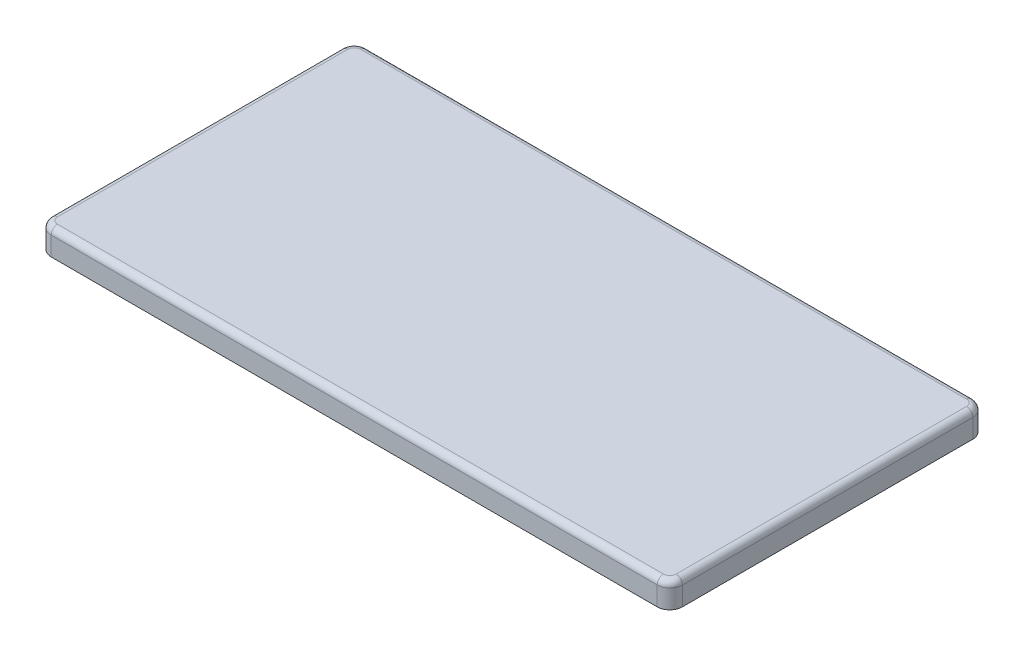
from build123d import *

# Parameters (mm, degrees)
EXTRUDE_1_DEPTH           = 2
FILLET_1_R                = 1
CUT_EXTRUDE_2_DEPTH       = 2
EXTRUDE_4_DEPTH           = 11
EXTRUDE_4_DRAFT           = 0.5
EXTRUDE_4_PROFILE_2_DEPTH = 11
EXTRUDE_4_PROFILE_2_DRAFT = 0.5
FILLET_2_R                = 0.8


with BuildPart() as part:
    # Sketch 1 → Extrude 1 (new, symmetric)
    with BuildSketch(Plane(origin=(0, 0, 0), x_dir=(0, 0, -1), z_dir=(0, 1, 0))):
        with BuildLine():
            Line((-23, 50), (23, 50))
            ThreePointArc((23, 50), (24.414213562, 49.414213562), (25, 48))
            Line((25, 48), (25, -48))
            ThreePointArc((25, -48), (24.414213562, -49.414213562), (23, -50))
            Line((23, -50), (-23, -50))
            ThreePointArc((-23, -50), (-24.414213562, -49.414213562), (-25, -48))
            Line((-25, -48), (-25, 48))
            ThreePointArc((-25, 48), (-24.414213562, 49.414213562), (-23, 50))
        make_face()
    extrude(amount=EXTRUDE_1_DEPTH, both=True)

    # Fillet 1
    fillet_1_edges = [part.edges().sort_by_distance(p)[0] for p in [
        (-49.414213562, 2, 24.414213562),
        (0, 2, 25),
        (49.414213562, 2, 24.414213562),
        (50, 2, 0),
        (49.414213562, 2, -24.414213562),
        (0, 2, -25),
        (-49.414213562, 2, -24.414213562),
        (-50, 2, 0),
    ]]
    fillet(fillet_1_edges, radius=FILLET_1_R)

    # Sketch 2 → Cut-Extrude 2 (cut)
    with BuildSketch(Plane.XZ.offset(2)):
        with BuildLine():
            Line((-47.2, 23), (47.2, 23))
            ThreePointArc((47.2, 23), (47.765685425, 22.765685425), (48, 22.2))
            Line((48, 22.2), (48, -22.2))
            ThreePointArc((48, -22.2), (47.765685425, -22.765685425), (47.2, -23))
            Line((47.2, -23), (-47.2, -23))
            ThreePointArc((-47.2, -23), (-47.765685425, -22.765685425), (-48, -22.2))
            Line((-48, -22.2), (-48, 22.2))
            ThreePointArc((-48, 22.2), (-47.765685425, 22.765685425), (-47.2, 23))
        make_face()
    extrude(amount=-CUT_EXTRUDE_2_DEPTH, mode=Mode.SUBTRACT)


with BuildPart() as extrude_4_tool:
    # Sketch 4 → Extrude 4 (with draft: the straight prism first)
    with BuildSketch(Plane.XZ):
        Polygon((-33.74766594, 0.707106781), (-29.292893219, -3.74766594), (-26.25233406, -0.707106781), (-30.707106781, 3.74766594), align=None)
    extrude(amount=EXTRUDE_4_DEPTH)
    # Extrude 4: the draft: its side faces are tilted about the plane it starts from
    extrude_4_sides = [extrude_4_tool.faces().sort_by_distance(p)[0] for p in [
        (-31.52027958, -5.5, -1.52027958),
        (-27.772613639, -5.5, -2.227386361),
        (-28.47972042, -5.5, 1.52027958),
        (-32.227386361, -5.5, 2.227386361),
    ]]
    draft(extrude_4_sides, Plane.XZ, EXTRUDE_4_DRAFT)


with BuildPart() as part_1:
    add(part.part)

    # Extrude 4: add extrude_4_tool
    add(extrude_4_tool.part)


with BuildPart() as extrude_4_profile_2_tool:
    # Sketch 4 → Extrude 4 profile 2 (with draft: the straight prism first)
    with BuildSketch(Plane.XZ):
        Polygon((26.25233406, 0.707106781), (30.707106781, -3.74766594), (33.74766594, -0.707106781), (29.292893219, 3.74766594), align=None)
    extrude(amount=EXTRUDE_4_PROFILE_2_DEPTH)
    # Extrude 4 profile 2: the draft: its side faces are tilted about the plane it starts from
    extrude_4_profile_2_sides = [extrude_4_profile_2_tool.faces().sort_by_distance(p)[0] for p in [
        (28.47972042, -5.5, -1.52027958),
        (32.227386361, -5.5, -2.227386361),
        (31.52027958, -5.5, 1.52027958),
        (27.772613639, -5.5, 2.227386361),
    ]]
    draft(extrude_4_profile_2_sides, Plane.XZ, EXTRUDE_4_PROFILE_2_DRAFT)


with BuildPart() as part_2:
    add(part_1.part)

    # Extrude 4 profile 2: add extrude_4_profile_2_tool
    add(extrude_4_profile_2_tool.part)

    # Fillet 2
    fillet_2_edges = [part_2.edges().sort_by_distance(p)[0] for p in [
        (-31.452400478, -11, -1.452400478),
        (-27.840492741, -11, -2.159507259),
        (-28.547599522, -11, 1.452400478),
        (-32.159507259, -11, 2.159507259),
        (28.547599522, -11, -1.452400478),
        (32.159507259, -11, -2.159507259),
        (31.452400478, -11, 1.452400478),
        (27.840492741, -11, 2.159507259),
    ]]
    fillet(fillet_2_edges, radius=FILLET_2_R)


solid = part_2.part
